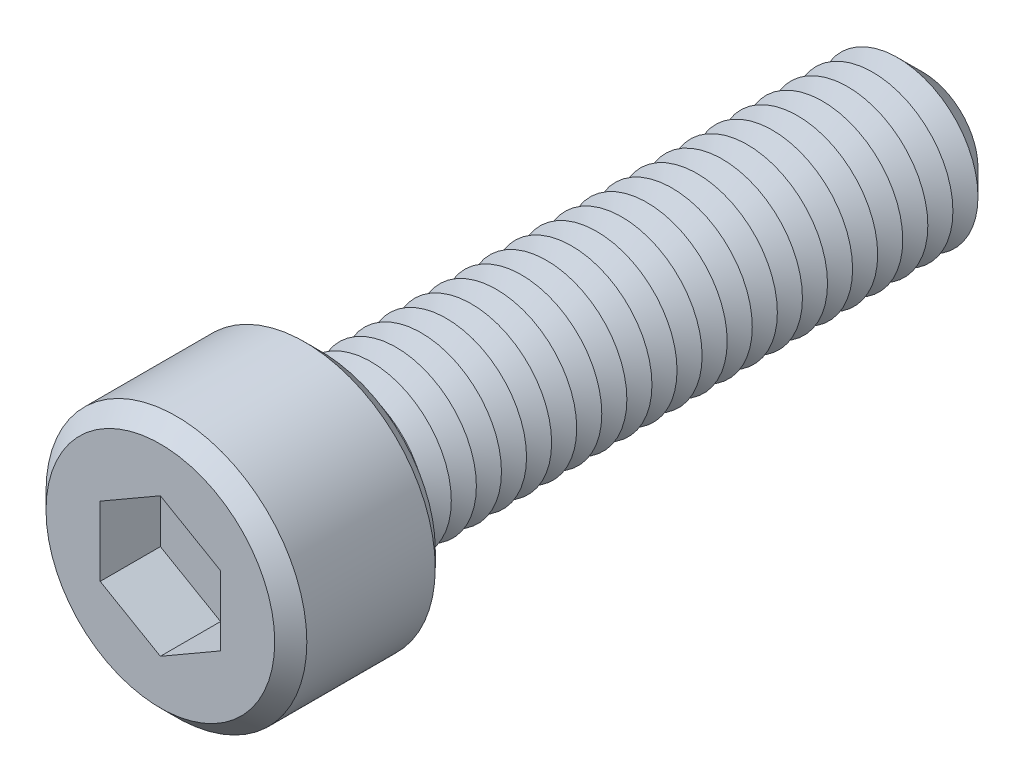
from build123d import *

# Parameters (mm, degrees)
SKETCH1_R           = 6.5
BOSS_EXTRUDE1_DEPTH = 8
SKETCH2_R           = 4
BOSS_EXTRUDE2_DEPTH = 30
CHAMFER1_SIZE       = 1.25
LPATTERN1_COUNT     = 23
LPATTERN1_PITCH     = 1.25
CUT_EXTRUDE1_DEPTH  = 3
SKETCH6_R           = 0.9
CUT_EXTRUDE2_DEPTH  = 35
CHAMFER2_SIZE       = 0.8


with BuildPart() as part:
    # Sketch1 → Boss-Extrude1 (new body)
    with BuildSketch(Plane.XY):
        Circle(SKETCH1_R)
    extrude(amount=BOSS_EXTRUDE1_DEPTH)

    # Sketch2 → Boss-Extrude2 (add)
    with BuildSketch(Plane(origin=(0, 0, 0), x_dir=(-1, 0, 0), z_dir=(0, 0, -1))):
        Circle(SKETCH2_R)
    extrude(amount=BOSS_EXTRUDE2_DEPTH)

    # Chamfer1
    chamfer1_edges = [part.edges().sort_by_distance(p)[0] for p in [
        (4, 0, -30),
    ]]
    chamfer(chamfer1_edges, length=CHAMFER1_SIZE)

    # Sketch4 → Cut-Revolve1 (revolve, cut)
    with BuildSketch(Plane(origin=(0, 0, 0), x_dir=(0, 0, -1), z_dir=(1, 0, 0)), mode=Mode.PRIVATE) as cut_revolve1_sk:
        Polygon((0, 4), (0.625, 2.917468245), (1.25, 4), align=None)
    cut_revolve1 = revolve(cut_revolve1_sk.sketch.rotate(Axis((0, 0, 2.512122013), (0, 0, -1)), 90), axis=Axis((0, 0, 2.512122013), (0, 0, -1)), mode=Mode.SUBTRACT)

    # LPattern1: Cut-Revolve1 ×23
    with Locations(*[(0, 0, -i * LPATTERN1_PITCH) for i in range(1, LPATTERN1_COUNT)]):
        add(cut_revolve1, mode=Mode.SUBTRACT)

    # Sketch5 → Cut-Extrude1 (cut)
    with BuildSketch(Plane.XY.offset(8)):
        Polygon((0, 3.464101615), (-3, 1.732050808), (-3, -1.732050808), (0, -3.464101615), (3, -1.732050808), (3, 1.732050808), align=None)
    extrude(amount=-CUT_EXTRUDE1_DEPTH, mode=Mode.SUBTRACT)

    # Sketch6 → Cut-Extrude2 (cut)
    with BuildSketch(Plane.XY.offset(5)):
        Circle(SKETCH6_R)
    extrude(amount=-CUT_EXTRUDE2_DEPTH, mode=Mode.SUBTRACT)

    # Chamfer2
    chamfer2_edges = [part.edges().sort_by_distance(p)[0] for p in [
        (-6.5, 0, 0),
        (-6.5, 0, 8),
    ]]
    chamfer(chamfer2_edges, length=CHAMFER2_SIZE)


solid = part.part
